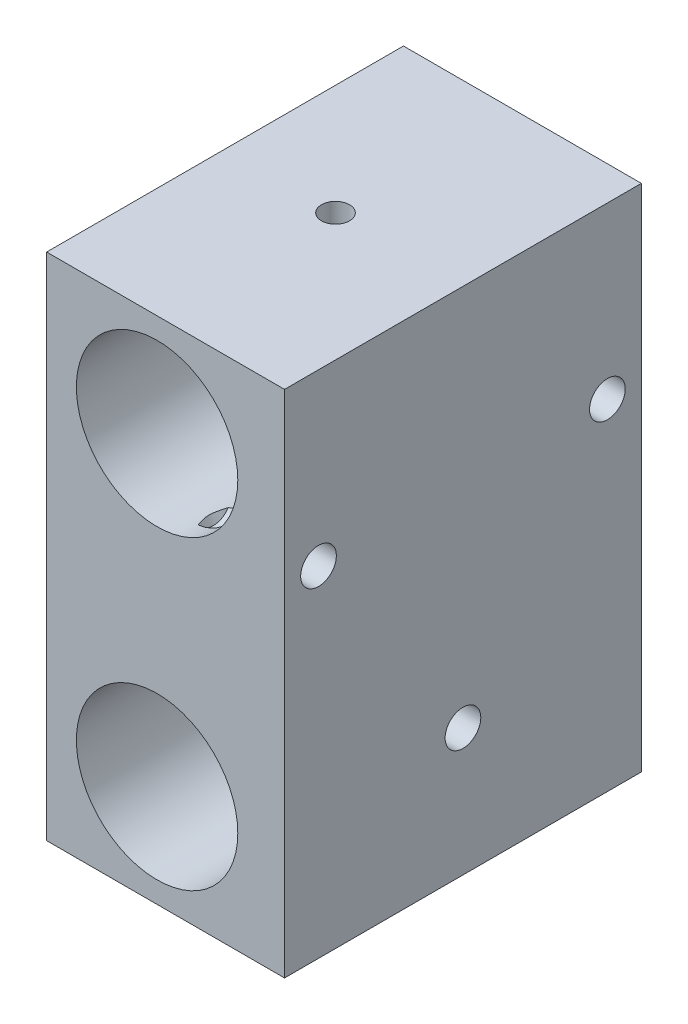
ISO-10303-21;
HEADER;
FILE_DESCRIPTION(('STEP AP214'),'2;1');
FILE_NAME('part.step','',(''),(''),'','','');
FILE_SCHEMA(('AUTOMOTIVE_DESIGN { 1 0 10303 214 1 1 1 1 }'));
ENDSEC;
DATA;
#1=APPLICATION_CONTEXT('core data for automotive mechanical design processes');
#2=APPLICATION_PROTOCOL_DEFINITION('international standard','automotive_design',2000,#1);
#3=PRODUCT_CONTEXT('',#1,'mechanical');
#4=PRODUCT('Part','Part','',(#3));
#5=PRODUCT_RELATED_PRODUCT_CATEGORY('part','',(#4));
#6=PRODUCT_DEFINITION_FORMATION('','',#4);
#7=PRODUCT_DEFINITION_CONTEXT('part definition',#1,'design');
#8=PRODUCT_DEFINITION('design','',#6,#7);
#9=PRODUCT_DEFINITION_SHAPE('','',#8);
#10=(LENGTH_UNIT() NAMED_UNIT(*) SI_UNIT(.MILLI.,.METRE.));
#11=(NAMED_UNIT(*) PLANE_ANGLE_UNIT() SI_UNIT($,.RADIAN.));
#12=(NAMED_UNIT(*) SI_UNIT($,.STERADIAN.) SOLID_ANGLE_UNIT());
#13=UNCERTAINTY_MEASURE_WITH_UNIT(LENGTH_MEASURE(1.E-05),#10,'distance_accuracy_value','');
#14=(GEOMETRIC_REPRESENTATION_CONTEXT(3) GLOBAL_UNCERTAINTY_ASSIGNED_CONTEXT((#13)) GLOBAL_UNIT_ASSIGNED_CONTEXT((#10,
#11,#12)) REPRESENTATION_CONTEXT('',''));
#15=CARTESIAN_POINT('',(0.,0.,0.));
#16=DIRECTION('',(0.,0.,1.));
#17=DIRECTION('',(1.,0.,0.));
#18=AXIS2_PLACEMENT_3D('',#15,#16,#17);
#19=CARTESIAN_POINT('',(14.,0.,-5.99999999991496));
#20=DIRECTION('',(0.,0.,-1.));
#21=DIRECTION('',(-1.,0.,0.));
#22=AXIS2_PLACEMENT_3D('',#19,#20,#21);
#23=CONICAL_SURFACE('',#22,2.49999999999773,1.02974425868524);
#24=CARTESIAN_POINT('',(14.,5.68422245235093E-11,-4.49784845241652));
#25=VERTEX_POINT('',#24);
#26=VERTEX_LOOP('',#25);
#27=FACE_BOUND('',#26,.T.);
#28=CARTESIAN_POINT('',(14.,0.,-6.));
#29=DIRECTION('',(0.,0.,-1.));
#30=DIRECTION('',(0.,1.,0.));
#31=AXIS2_PLACEMENT_3D('',#28,#29,#30);
#32=CIRCLE('',#31,2.5);
#33=CARTESIAN_POINT('',(14.,2.5,-6.));
#34=VERTEX_POINT('',#33);
#35=EDGE_CURVE('E86',#34,#34,#32,.T.);
#36=ORIENTED_EDGE('',*,*,#35,.T.);
#37=EDGE_LOOP('',(#36));
#38=FACE_BOUND('',#37,.T.);
#39=ADVANCED_FACE('F17',(#27,#38),#23,.F.);
#40=CARTESIAN_POINT('',(15.6000000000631,10.,-17.));
#41=DIRECTION('',(1.,0.,0.));
#42=DIRECTION('',(0.,0.,-1.));
#43=AXIS2_PLACEMENT_3D('',#40,#41,#42);
#44=CONICAL_SURFACE('',#43,2.10000000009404,1.02974425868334);
#45=CARTESIAN_POINT('',(15.6000000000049,8.86271375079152,-18.7653838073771));
#46=CARTESIAN_POINT('',(15.578058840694,8.85647008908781,-18.7179170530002));
#47=CARTESIAN_POINT('',(15.5563928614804,8.85039092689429,-18.6703017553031));
#48=CARTESIAN_POINT('',(15.5137294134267,8.83857796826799,-18.5747211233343));
#49=CARTESIAN_POINT('',(15.4927320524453,8.83284422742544,-18.5267557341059));
#50=CARTESIAN_POINT('',(15.430778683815,8.81614767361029,-18.3819226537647));
#51=CARTESIAN_POINT('',(15.3910250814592,8.80573585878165,-18.2844675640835));
#52=CARTESIAN_POINT('',(15.3154493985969,8.78640988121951,-18.0856419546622));
#53=CARTESIAN_POINT('',(15.2797207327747,8.77752944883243,-17.9842321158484));
#54=CARTESIAN_POINT('',(15.2155461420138,8.76190242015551,-17.779032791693));
#55=CARTESIAN_POINT('',(15.1870902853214,8.75515291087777,-17.6752467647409));
#56=CARTESIAN_POINT('',(15.1476650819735,8.74592972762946,-17.496865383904));
#57=CARTESIAN_POINT('',(15.1340102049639,8.74278040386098,-17.4229084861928));
#58=CARTESIAN_POINT('',(15.1129628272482,8.7379534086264,-17.2740522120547));
#59=CARTESIAN_POINT('',(15.1055685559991,8.73627532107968,-17.1991531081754));
#60=CARTESIAN_POINT('',(15.0978524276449,8.73452469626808,-17.0497107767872));
#61=CARTESIAN_POINT('',(15.0974606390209,8.73443628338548,-16.9751714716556));
#62=CARTESIAN_POINT('',(15.1036106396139,8.73583084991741,-16.8263965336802));
#63=CARTESIAN_POINT('',(15.1101535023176,8.73731407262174,-16.7521609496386));
#64=CARTESIAN_POINT('',(15.1333371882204,8.74262107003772,-16.575323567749));
#65=CARTESIAN_POINT('',(15.1529520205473,8.74713940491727,-16.4731377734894));
#66=CARTESIAN_POINT('',(15.2013889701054,8.75854485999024,-16.2711028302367));
#67=CARTESIAN_POINT('',(15.230221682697,8.76543470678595,-16.1712565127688));
#68=CARTESIAN_POINT('',(15.2945426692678,8.78120495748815,-15.9729019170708));
#69=CARTESIAN_POINT('',(15.330090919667,8.79010345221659,-15.8744150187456));
#70=CARTESIAN_POINT('',(15.4055636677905,8.80952764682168,-15.6793786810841));
#71=CARTESIAN_POINT('',(15.4454860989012,8.82005257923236,-15.5828283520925));
#72=CARTESIAN_POINT('',(15.5052870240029,8.83627249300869,-15.4445486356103));
#73=CARTESIAN_POINT('',(15.5239532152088,8.84139498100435,-15.4022189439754));
#74=CARTESIAN_POINT('',(15.561677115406,8.85187499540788,-15.3180943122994));
#75=CARTESIAN_POINT('',(15.5807315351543,8.85723079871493,-15.276297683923));
#76=CARTESIAN_POINT('',(15.6000000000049,8.86271375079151,-15.2346161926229));
#77=B_SPLINE_CURVE_WITH_KNOTS('',3,(#45,#46,#47,#48,#49,#50,#51,#52,#53,#54,#55,#56,#57,#58,#59,
#60,#61,#62,#63,#64,#65,#66,#67,#68,#69,#70,#71,#72,#73,#74,#75,#76),.UNSPECIFIED.,.F.,.F.,(4,2,
2,2,2,2,2,2,2,2,2,2,2,2,2,4),(0.,0.157989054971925,0.316003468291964,0.633197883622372,
0.956671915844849,1.27970182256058,1.50528927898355,1.73081291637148,1.95408304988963,
2.17738775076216,2.48917756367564,2.80132705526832,3.11640880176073,3.43134232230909,
3.57097549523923,3.70971081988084),.UNSPECIFIED.);
#78=CARTESIAN_POINT('',(15.6000000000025,8.86271375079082,-18.7653838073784));
#79=VERTEX_POINT('',#78);
#80=CARTESIAN_POINT('',(15.6000000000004,8.86271375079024,-15.2346161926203));
#81=VERTEX_POINT('',#80);
#82=EDGE_CURVE('E81',#79,#81,#77,.T.);
#83=ORIENTED_EDGE('',*,*,#82,.T.);
#84=CARTESIAN_POINT('',(15.6,10.,-17.));
#85=DIRECTION('',(1.,0.,0.));
#86=DIRECTION('',(0.,0.,-1.));
#87=AXIS2_PLACEMENT_3D('',#84,#85,#86);
#88=CIRCLE('',#87,2.09999999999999);
#89=EDGE_CURVE('E74',#81,#79,#88,.T.);
#90=ORIENTED_EDGE('',*,*,#89,.T.);
#91=EDGE_LOOP('',(#83,#90));
#92=FACE_BOUND('',#91,.T.);
#93=ADVANCED_FACE('F89',(#92),#44,.F.);
#94=CARTESIAN_POINT('',(15.6000000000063,10.,17.));
#95=DIRECTION('',(1.,0.,0.));
#96=DIRECTION('',(0.,0.,-1.));
#97=AXIS2_PLACEMENT_3D('',#94,#95,#96);
#98=CONICAL_SURFACE('',#97,2.09999999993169,1.0297442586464);
#99=CARTESIAN_POINT('',(15.6000000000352,8.86271375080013,15.234616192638));
#100=CARTESIAN_POINT('',(15.5780588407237,8.85647008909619,15.2820829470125));
#101=CARTESIAN_POINT('',(15.5563928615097,8.85039092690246,15.3296982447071));
#102=CARTESIAN_POINT('',(15.5137294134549,8.83857796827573,15.4252788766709));
#103=CARTESIAN_POINT('',(15.4927320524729,8.83284422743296,15.4732442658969));
#104=CARTESIAN_POINT('',(15.430778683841,8.81614767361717,15.6180773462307));
#105=CARTESIAN_POINT('',(15.391025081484,8.8057358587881,15.7155324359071));
#106=CARTESIAN_POINT('',(15.3154493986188,8.78640988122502,15.9143580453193));
#107=CARTESIAN_POINT('',(15.279720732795,8.77752944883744,16.0157678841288));
#108=CARTESIAN_POINT('',(15.2155461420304,8.76190242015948,16.220967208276));
#109=CARTESIAN_POINT('',(15.187090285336,8.75515291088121,16.324753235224));
#110=CARTESIAN_POINT('',(15.1476650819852,8.74592972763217,16.5031346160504));
#111=CARTESIAN_POINT('',(15.1340102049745,8.74278040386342,16.5770915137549));
#112=CARTESIAN_POINT('',(15.1129628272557,8.73795340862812,16.72594778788));
#113=CARTESIAN_POINT('',(15.1055685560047,8.73627532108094,16.8008468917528));
#114=CARTESIAN_POINT('',(15.0978524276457,8.73452469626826,16.9502892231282));
#115=CARTESIAN_POINT('',(15.097460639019,8.73443628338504,17.0248285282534));
#116=CARTESIAN_POINT('',(15.1036106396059,8.73583084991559,17.1736034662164));
#117=CARTESIAN_POINT('',(15.1101535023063,8.73731407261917,17.2478390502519));
#118=CARTESIAN_POINT('',(15.1333371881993,8.74262107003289,17.4246764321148));
#119=CARTESIAN_POINT('',(15.1529520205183,8.74713940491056,17.526862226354));
#120=CARTESIAN_POINT('',(15.2013889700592,8.75854485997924,17.7288971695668));
#121=CARTESIAN_POINT('',(15.2302216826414,8.76543470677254,17.8287434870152));
#122=CARTESIAN_POINT('',(15.2945426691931,8.78120495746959,18.0270980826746));
#123=CARTESIAN_POINT('',(15.3300909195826,8.79010345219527,18.1255849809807));
#124=CARTESIAN_POINT('',(15.4055636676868,8.80952764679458,18.3206213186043));
#125=CARTESIAN_POINT('',(15.4454860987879,8.82005257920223,18.4171716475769));
#126=CARTESIAN_POINT('',(15.5052870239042,8.83627249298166,18.5554513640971));
#127=CARTESIAN_POINT('',(15.5239532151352,8.84139498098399,18.5977810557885));
#128=CARTESIAN_POINT('',(15.5616771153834,8.85187499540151,18.6819056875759));
#129=CARTESIAN_POINT('',(15.5807315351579,8.85723079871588,18.7237023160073));
#130=CARTESIAN_POINT('',(15.6000000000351,8.86271375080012,18.765383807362));
#131=B_SPLINE_CURVE_WITH_KNOTS('',3,(#99,#100,#101,#102,#103,#104,#105,#106,#107,#108,#109,#110,
#111,#112,#113,#114,#115,#116,#117,#118,#119,#120,#121,#122,#123,#124,#125,#126,#127,#128,#129,
#130),.UNSPECIFIED.,.F.,.F.,(4,2,2,2,2,2,2,2,2,2,2,2,2,2,2,4),(0.,0.157989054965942,
0.316003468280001,0.633197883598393,0.956671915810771,1.27970182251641,1.50528927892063,
1.73081291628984,1.95408304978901,2.17738775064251,2.48917756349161,2.80132705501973,
3.11640880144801,3.43134232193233,3.57097549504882,3.70971081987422),.UNSPECIFIED.);
#132=CARTESIAN_POINT('',(15.6000000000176,8.86271375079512,15.2346161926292));
#133=VERTEX_POINT('',#132);
#134=CARTESIAN_POINT('',(15.6000000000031,8.86271375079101,18.7653838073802));
#135=VERTEX_POINT('',#134);
#136=EDGE_CURVE('E90',#133,#135,#131,.T.);
#137=ORIENTED_EDGE('',*,*,#136,.T.);
#138=CARTESIAN_POINT('',(15.6,10.,17.));
#139=DIRECTION('',(1.,0.,0.));
#140=DIRECTION('',(0.,0.,-1.));
#141=AXIS2_PLACEMENT_3D('',#138,#139,#140);
#142=CIRCLE('',#141,2.09999999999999);
#143=EDGE_CURVE('E87',#135,#133,#142,.T.);
#144=ORIENTED_EDGE('',*,*,#143,.T.);
#145=EDGE_LOOP('',(#137,#144));
#146=FACE_BOUND('',#145,.T.);
#147=ADVANCED_FACE('F142',(#146),#98,.F.);
#148=CARTESIAN_POINT('',(28.,-15.,0.));
#149=DIRECTION('',(1.,0.,0.));
#150=DIRECTION('',(0.,0.,-1.));
#151=AXIS2_PLACEMENT_3D('',#148,#149,#150);
#152=CYLINDRICAL_SURFACE('',#151,2.09999999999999);
#153=CARTESIAN_POINT('',(28.,-15.,0.));
#154=DIRECTION('',(1.,0.,0.));
#155=DIRECTION('',(0.,0.,-1.));
#156=AXIS2_PLACEMENT_3D('',#153,#154,#155);
#157=CIRCLE('',#156,2.09999999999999);
#158=CARTESIAN_POINT('',(28.,-15.,-2.09999999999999));
#159=VERTEX_POINT('',#158);
#160=EDGE_CURVE('E190',#159,#159,#157,.F.);
#161=ORIENTED_EDGE('',*,*,#160,.F.);
#162=EDGE_LOOP('',(#161));
#163=FACE_BOUND('',#162,.T.);
#164=CARTESIAN_POINT('',(22.01387818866,-15.,2.09999999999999));
#165=CARTESIAN_POINT('',(21.9717955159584,-14.8735703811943,2.09999446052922));
#166=CARTESIAN_POINT('',(21.9269801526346,-14.7478845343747,2.08854158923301));
#167=CARTESIAN_POINT('',(21.8334432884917,-14.5017555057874,2.04388629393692));
#168=CARTESIAN_POINT('',(21.7847127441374,-14.3813255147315,2.01063216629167));
#169=CARTESIAN_POINT('',(21.6854676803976,-14.1492169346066,1.92391922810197));
#170=CARTESIAN_POINT('',(21.6349586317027,-14.0375144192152,1.87051817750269));
#171=CARTESIAN_POINT('',(21.5342785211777,-13.8250845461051,1.74493709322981));
#172=CARTESIAN_POINT('',(21.4841074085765,-13.7243555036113,1.67275994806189));
#173=CARTESIAN_POINT('',(21.3851784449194,-13.5333790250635,1.50843392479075));
#174=CARTESIAN_POINT('',(21.3365130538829,-13.4435549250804,1.41573379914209));
#175=CARTESIAN_POINT('',(21.2456900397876,-13.2811800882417,1.21345605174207));
#176=CARTESIAN_POINT('',(21.2035308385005,-13.2086251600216,1.10388253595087));
#177=CARTESIAN_POINT('',(21.132190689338,-13.088580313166,0.878390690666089));
#178=CARTESIAN_POINT('',(21.1023058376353,-13.0396871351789,0.763459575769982));
#179=CARTESIAN_POINT('',(21.0665964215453,-12.9819799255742,0.584415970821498));
#180=CARTESIAN_POINT('',(21.0562137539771,-12.9653508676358,0.523636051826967));
#181=CARTESIAN_POINT('',(21.0387748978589,-12.937553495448,0.400380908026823));
#182=CARTESIAN_POINT('',(21.0317180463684,-12.9263840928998,0.337906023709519));
#183=CARTESIAN_POINT('',(21.0175274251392,-12.9039649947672,0.167996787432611));
#184=CARTESIAN_POINT('',(21.0137513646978,-12.8980586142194,0.0595034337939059));
#185=CARTESIAN_POINT('',(21.0169385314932,-12.9030698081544,-0.156855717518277));
#186=CARTESIAN_POINT('',(21.0238985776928,-12.9139823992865,-0.264721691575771));
#187=CARTESIAN_POINT('',(21.0469248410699,-12.9505037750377,-0.468482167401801));
#188=CARTESIAN_POINT('',(21.0622742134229,-12.974957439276,-0.564669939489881));
#189=CARTESIAN_POINT('',(21.1003321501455,-13.0365413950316,-0.751330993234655));
#190=CARTESIAN_POINT('',(21.1230423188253,-13.0736744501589,-0.841803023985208));
#191=CARTESIAN_POINT('',(21.1762010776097,-13.1623777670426,-1.02172783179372));
#192=CARTESIAN_POINT('',(21.2070931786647,-13.2148033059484,-1.1106252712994));
#193=CARTESIAN_POINT('',(21.2737448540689,-13.3309924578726,-1.2786158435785));
#194=CARTESIAN_POINT('',(21.3095064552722,-13.394760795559,-1.35770486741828));
#195=CARTESIAN_POINT('',(21.3894531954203,-13.5418587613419,-1.5156039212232));
#196=CARTESIAN_POINT('',(21.434113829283,-13.6266798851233,-1.5927855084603));
#197=CARTESIAN_POINT('',(21.5252668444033,-13.8071420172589,-1.73207990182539));
#198=CARTESIAN_POINT('',(21.5717611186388,-13.9027944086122,-1.79417663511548));
#199=CARTESIAN_POINT('',(21.6694416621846,-14.1134059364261,-1.90780665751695));
#200=CARTESIAN_POINT('',(21.7206106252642,-14.2293380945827,-1.95755846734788));
#201=CARTESIAN_POINT('',(21.8203767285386,-14.469034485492,-2.03565656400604));
#202=CARTESIAN_POINT('',(21.8689794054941,-14.5927804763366,-2.06405084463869));
#203=CARTESIAN_POINT('',(21.932407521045,-14.7651021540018,-2.08734757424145));
#204=CARTESIAN_POINT('',(21.9491746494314,-14.8117805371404,-2.09207615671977));
#205=CARTESIAN_POINT('',(21.9820430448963,-14.9055900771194,-2.09840360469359));
#206=CARTESIAN_POINT('',(21.998144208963,-14.9527213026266,-2.10000198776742));
#207=CARTESIAN_POINT('',(22.0522455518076,-15.1152892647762,-2.09999515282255));
#208=CARTESIAN_POINT('',(22.0884295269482,-15.2314554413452,-2.09047402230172));
#209=CARTESIAN_POINT('',(22.1555477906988,-15.4622000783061,-2.05184924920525));
#210=CARTESIAN_POINT('',(22.1864741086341,-15.576775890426,-2.02271620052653));
#211=CARTESIAN_POINT('',(22.2426645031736,-15.8007950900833,-1.94494031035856));
#212=CARTESIAN_POINT('',(22.2679211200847,-15.9102315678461,-1.896271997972));
#213=CARTESIAN_POINT('',(22.3127489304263,-16.1200454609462,-1.78040791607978));
#214=CARTESIAN_POINT('',(22.3323225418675,-16.2204267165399,-1.71322005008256));
#215=CARTESIAN_POINT('',(22.3657188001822,-16.4056648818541,-1.56453186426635));
#216=CARTESIAN_POINT('',(22.379705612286,-16.4909161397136,-1.4835590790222));
#217=CARTESIAN_POINT('',(22.403484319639,-16.6469559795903,-1.30817130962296));
#218=CARTESIAN_POINT('',(22.4132761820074,-16.7177444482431,-1.21375622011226));
#219=CARTESIAN_POINT('',(22.4293607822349,-16.8419620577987,-1.01525500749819));
#220=CARTESIAN_POINT('',(22.4356891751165,-16.895565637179,-0.911280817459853));
#221=CARTESIAN_POINT('',(22.4457096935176,-16.9848172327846,-0.695775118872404));
#222=CARTESIAN_POINT('',(22.4494018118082,-17.0204651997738,-0.584243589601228));
#223=CARTESIAN_POINT('',(22.4546879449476,-17.0728647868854,-0.356314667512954));
#224=CARTESIAN_POINT('',(22.4562736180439,-17.0895412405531,-0.239899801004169));
#225=CARTESIAN_POINT('',(22.4575845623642,-17.1032596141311,-0.00590701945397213));
#226=CARTESIAN_POINT('',(22.4573097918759,-17.1003010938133,0.111670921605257));
#227=CARTESIAN_POINT('',(22.4548487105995,-17.0747987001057,0.344992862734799));
#228=CARTESIAN_POINT('',(22.4526571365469,-17.0522009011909,0.4607309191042));
#229=CARTESIAN_POINT('',(22.4459994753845,-16.9880087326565,0.686747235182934));
#230=CARTESIAN_POINT('',(22.441533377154,-16.9464142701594,0.797025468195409));
#231=CARTESIAN_POINT('',(22.4297270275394,-16.8455253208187,1.00885220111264));
#232=CARTESIAN_POINT('',(22.4223899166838,-16.7862501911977,1.11041009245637));
#233=CARTESIAN_POINT('',(22.4040922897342,-16.6518037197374,1.30201302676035));
#234=CARTESIAN_POINT('',(22.3931322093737,-16.5766342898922,1.39205945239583));
#235=CARTESIAN_POINT('',(22.3668935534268,-16.4131441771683,1.55772443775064));
#236=CARTESIAN_POINT('',(22.3516350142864,-16.3248853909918,1.63340727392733));
#237=CARTESIAN_POINT('',(22.3161727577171,-16.1377493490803,1.76886110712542));
#238=CARTESIAN_POINT('',(22.2959676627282,-16.0388691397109,1.82862766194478));
#239=CARTESIAN_POINT('',(22.2502597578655,-15.8334864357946,1.93093144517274));
#240=CARTESIAN_POINT('',(22.2247469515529,-15.7269698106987,1.97343570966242));
#241=CARTESIAN_POINT('',(22.1685147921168,-15.5098461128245,2.04032641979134));
#242=CARTESIAN_POINT('',(22.1378028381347,-15.399245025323,2.06473835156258));
#243=CARTESIAN_POINT('',(22.0904414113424,-15.2402162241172,2.0867808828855));
#244=CARTESIAN_POINT('',(22.0757031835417,-15.1921271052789,2.09174784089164));
#245=CARTESIAN_POINT('',(22.0454002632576,-15.0959896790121,2.09835821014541));
#246=CARTESIAN_POINT('',(22.0298356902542,-15.0479413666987,2.10000210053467));
#247=CARTESIAN_POINT('',(22.01387818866,-15.,2.09999999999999));
#248=B_SPLINE_CURVE_WITH_KNOTS('',3,(#164,#165,#166,#167,#168,#169,#170,#171,#172,#173,#174,
#175,#176,#177,#178,#179,#180,#181,#182,#183,#184,#185,#186,#187,#188,#189,#190,#191,#192,#193,
#194,#195,#196,#197,#198,#199,#200,#201,#202,#203,#204,#205,#206,#207,#208,#209,#210,#211,#212,
#213,#214,#215,#216,#217,#218,#219,#220,#221,#222,#223,#224,#225,#226,#227,#228,#229,#230,#231,
#232,#233,#234,#235,#236,#237,#238,#239,#240,#241,#242,#243,#244,#245,#246,#247),.UNSPECIFIED.,
.T.,.F.,(4,2,2,2,2,2,2,2,2,2,2,2,2,2,2,2,2,2,2,2,2,2,2,2,2,2,2,2,2,2,2,2,2,2,2,2,2,2,2,2,2,4),
(0.,0.399552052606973,0.800055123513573,1.19941859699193,1.59872066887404,2.01043941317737,
2.42205812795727,2.80474663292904,2.99603655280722,3.18728832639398,3.51150982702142,
3.83563528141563,4.13561961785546,4.43566938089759,4.75759759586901,5.0796602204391,
5.44737174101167,5.81547335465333,6.22203357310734,6.62767743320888,6.77706517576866,
6.92647593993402,7.29081459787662,7.65570076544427,8.02106424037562,8.38627203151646,
8.73977874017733,9.09328821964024,9.44308651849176,9.79288577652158,10.1440661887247,
10.4952544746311,10.8474101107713,11.1995674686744,11.551340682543,11.9030716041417,
12.2531893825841,12.6034047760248,12.9542858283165,13.3046716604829,13.4562012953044,
13.6077090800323),.UNSPECIFIED.);
#249=CARTESIAN_POINT('',(22.01387818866,-15.,2.09999999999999));
#250=VERTEX_POINT('',#249);
#251=EDGE_CURVE('E83',#250,#250,#248,.T.);
#252=ORIENTED_EDGE('',*,*,#251,.T.);
#253=EDGE_LOOP('',(#252));
#254=FACE_BOUND('',#253,.T.);
#255=ADVANCED_FACE('F137',(#163,#254),#152,.F.);
#256=CARTESIAN_POINT('',(28.,10.,17.));
#257=DIRECTION('',(1.,0.,0.));
#258=DIRECTION('',(0.,0.,-1.));
#259=AXIS2_PLACEMENT_3D('',#256,#257,#258);
#260=CYLINDRICAL_SURFACE('',#259,2.09999999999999);
#261=CARTESIAN_POINT('',(28.,10.,17.));
#262=DIRECTION('',(1.,0.,0.));
#263=DIRECTION('',(0.,0.,-1.));
#264=AXIS2_PLACEMENT_3D('',#261,#262,#263);
#265=CIRCLE('',#264,2.09999999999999);
#266=CARTESIAN_POINT('',(28.,10.,14.9));
#267=VERTEX_POINT('',#266);
#268=EDGE_CURVE('E188',#267,#267,#265,.F.);
#269=ORIENTED_EDGE('',*,*,#268,.F.);
#270=EDGE_LOOP('',(#269));
#271=FACE_BOUND('',#270,.T.);
#272=ORIENTED_EDGE('',*,*,#143,.F.);
#273=CARTESIAN_POINT('',(15.6000000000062,8.8627137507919,18.7653838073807));
#274=CARTESIAN_POINT('',(15.8164353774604,8.92431926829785,18.8050675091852));
#275=CARTESIAN_POINT('',(16.0307223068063,8.99358938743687,18.8451254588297));
#276=CARTESIAN_POINT('',(16.4553755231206,9.14778421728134,18.9212399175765));
#277=CARTESIAN_POINT('',(16.6657209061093,9.23277517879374,18.9572784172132));
#278=CARTESIAN_POINT('',(17.0887019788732,9.42164917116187,19.0213444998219));
#279=CARTESIAN_POINT('',(17.3011325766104,9.52611662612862,19.0490248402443));
#280=CARTESIAN_POINT('',(17.7184688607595,9.75124032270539,19.0883399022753));
#281=CARTESIAN_POINT('',(17.9233892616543,9.87186248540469,19.1000078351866));
#282=CARTESIAN_POINT('',(18.2381662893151,10.0734494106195,19.0999955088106));
#283=CARTESIAN_POINT('',(18.3512688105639,10.1493681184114,19.0961547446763));
#284=CARTESIAN_POINT('',(18.573613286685,10.3056342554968,19.0791264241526));
#285=CARTESIAN_POINT('',(18.682857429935,10.3859791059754,19.0659442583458));
#286=CARTESIAN_POINT('',(18.8954764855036,10.5494204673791,19.028567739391));
#287=CARTESIAN_POINT('',(18.9989022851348,10.6324775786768,19.0044946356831));
#288=CARTESIAN_POINT('',(19.1998742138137,10.8007845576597,18.9433857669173));
#289=CARTESIAN_POINT('',(19.2974269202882,10.8860318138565,18.9063648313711));
#290=CARTESIAN_POINT('',(19.4869867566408,11.0584080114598,18.8164240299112));
#291=CARTESIAN_POINT('',(19.5788583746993,11.1455426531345,18.7632234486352));
#292=CARTESIAN_POINT('',(19.7529942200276,11.3170385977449,18.6390836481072));
#293=CARTESIAN_POINT('',(19.8352578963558,11.4013997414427,18.5681434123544));
#294=CARTESIAN_POINT('',(19.9761870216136,11.5508322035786,18.4192663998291));
#295=CARTESIAN_POINT('',(20.036542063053,11.6169035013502,18.3439533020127));
#296=CARTESIAN_POINT('',(20.1466450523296,11.74042260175,18.1796079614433));
#297=CARTESIAN_POINT('',(20.1963965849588,11.7978733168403,18.0905803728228));
#298=CARTESIAN_POINT('',(20.2838944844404,11.9008596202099,17.8992375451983));
#299=CARTESIAN_POINT('',(20.3215329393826,11.9462874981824,17.7968137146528));
#300=CARTESIAN_POINT('',(20.3825619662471,12.0208577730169,17.5822288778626));
#301=CARTESIAN_POINT('',(20.4059661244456,12.0500156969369,17.470077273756));
#302=CARTESIAN_POINT('',(20.4351027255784,12.0864817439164,17.2577178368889));
#303=CARTESIAN_POINT('',(20.4429601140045,12.0964122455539,17.1582434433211));
#304=CARTESIAN_POINT('',(20.4473586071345,12.1019603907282,16.9586634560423));
#305=CARTESIAN_POINT('',(20.4439050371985,12.0975847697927,16.8585581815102));
#306=CARTESIAN_POINT('',(20.426446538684,12.0756385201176,16.6678884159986));
#307=CARTESIAN_POINT('',(20.4131901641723,12.0590042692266,16.5771438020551));
#308=CARTESIAN_POINT('',(20.3774065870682,12.0146279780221,16.4003493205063));
#309=CARTESIAN_POINT('',(20.3548795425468,11.986886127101,16.314299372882));
#310=CARTESIAN_POINT('',(20.3003125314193,11.9207465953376,16.1460853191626));
#311=CARTESIAN_POINT('',(20.2679840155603,11.8820284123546,16.064142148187));
#312=CARTESIAN_POINT('',(20.1950198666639,11.7963840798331,15.908721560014));
#313=CARTESIAN_POINT('',(20.1543815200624,11.7494552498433,15.8352469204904));
#314=CARTESIAN_POINT('',(20.060475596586,11.6434873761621,15.6892644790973));
#315=CARTESIAN_POINT('',(20.0062788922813,11.5836712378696,15.617923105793));
#316=CARTESIAN_POINT('',(19.890097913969,11.4590639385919,15.4869494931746));
#317=CARTESIAN_POINT('',(19.8281085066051,11.394269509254,15.4273250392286));
#318=CARTESIAN_POINT('',(19.6599544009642,11.2238432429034,15.2881800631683));
#319=CARTESIAN_POINT('',(19.5489173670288,11.1161937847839,15.2169921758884));
#320=CARTESIAN_POINT('',(19.3147367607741,10.9007306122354,15.0989860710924));
#321=CARTESIAN_POINT('',(19.1915656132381,10.7929170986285,15.0522249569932));
#322=CARTESIAN_POINT('',(18.9169148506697,10.5651799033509,14.9733743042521));
#323=CARTESIAN_POINT('',(18.763976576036,10.4459029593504,14.9445904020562));
#324=CARTESIAN_POINT('',(18.4495884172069,10.2160410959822,14.9079006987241));
#325=CARTESIAN_POINT('',(18.2881378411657,10.10545688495,14.8999965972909));
#326=CARTESIAN_POINT('',(17.9740532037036,9.90430364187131,14.9000030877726));
#327=CARTESIAN_POINT('',(17.8219861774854,9.81282941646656,14.9065176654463));
#328=CARTESIAN_POINT('',(17.5135122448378,9.63880301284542,14.9294346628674));
#329=CARTESIAN_POINT('',(17.3571026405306,9.55625654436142,14.9458433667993));
#330=CARTESIAN_POINT('',(16.8820569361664,9.32219445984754,15.0058662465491));
#331=CARTESIAN_POINT('',(16.5578868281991,9.18443666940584,15.0602666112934));
#332=CARTESIAN_POINT('',(16.1245200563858,9.02784413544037,15.1381031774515));
#333=CARTESIAN_POINT('',(16.0201946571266,8.99219240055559,15.1572201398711));
#334=CARTESIAN_POINT('',(15.8107676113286,8.92466961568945,15.1957898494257));
#335=CARTESIAN_POINT('',(15.7056695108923,8.89278684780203,15.2152413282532));
#336=CARTESIAN_POINT('',(15.6000000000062,8.86271375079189,15.2346161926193));
#337=B_SPLINE_CURVE_WITH_KNOTS('',3,(#273,#274,#275,#276,#277,#278,#279,#280,#281,#282,#283,
#284,#285,#286,#287,#288,#289,#290,#291,#292,#293,#294,#295,#296,#297,#298,#299,#300,#301,#302,
#303,#304,#305,#306,#307,#308,#309,#310,#311,#312,#313,#314,#315,#316,#317,#318,#319,#320,#321,
#322,#323,#324,#325,#326,#327,#328,#329,#330,#331,#332,#333,#334,#335,#336),.UNSPECIFIED.,.F.,
.F.,(4,2,2,2,2,2,2,2,2,2,2,2,2,2,2,2,2,2,2,2,2,2,2,2,2,2,2,2,2,2,2,4),(0.,0.685540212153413,
1.37403812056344,2.08810724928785,2.80069307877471,3.2091527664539,3.61737693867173,
4.02116409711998,4.42449029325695,4.83525736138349,5.2460479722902,5.59553958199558,
5.94491284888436,6.29731755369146,6.64938536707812,6.94861716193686,7.24770809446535,
7.52605143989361,7.8043900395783,8.09188451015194,8.3794730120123,8.70145402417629,
9.0236482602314,9.53149772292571,10.040529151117,10.6268485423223,11.2132156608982,
11.7453117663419,12.2777461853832,13.3436132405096,13.6792713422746,14.0138567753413),.UNSPECIFIED.);
#338=EDGE_CURVE('E93',#135,#133,#337,.T.);
#339=ORIENTED_EDGE('',*,*,#338,.T.);
#340=EDGE_LOOP('',(#272,#339));
#341=FACE_BOUND('',#340,.T.);
#342=ADVANCED_FACE('F133',(#271,#341),#260,.F.);
#343=CARTESIAN_POINT('',(28.,10.,-17.));
#344=DIRECTION('',(1.,0.,0.));
#345=DIRECTION('',(0.,0.,-1.));
#346=AXIS2_PLACEMENT_3D('',#343,#344,#345);
#347=CYLINDRICAL_SURFACE('',#346,2.09999999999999);
#348=CARTESIAN_POINT('',(28.,10.,-17.));
#349=DIRECTION('',(1.,0.,0.));
#350=DIRECTION('',(0.,0.,-1.));
#351=AXIS2_PLACEMENT_3D('',#348,#349,#350);
#352=CIRCLE('',#351,2.09999999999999);
#353=CARTESIAN_POINT('',(28.,10.,-19.1));
#354=VERTEX_POINT('',#353);
#355=EDGE_CURVE('E185',#354,#354,#352,.F.);
#356=ORIENTED_EDGE('',*,*,#355,.F.);
#357=EDGE_LOOP('',(#356));
#358=FACE_BOUND('',#357,.T.);
#359=ORIENTED_EDGE('',*,*,#89,.F.);
#360=CARTESIAN_POINT('',(15.6000000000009,8.86271375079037,-15.2346161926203));
#361=CARTESIAN_POINT('',(15.8164353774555,8.92431926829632,-15.1949324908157));
#362=CARTESIAN_POINT('',(16.0307223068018,8.99358938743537,-15.1548745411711));
#363=CARTESIAN_POINT('',(16.4553755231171,9.14778421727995,-15.0787600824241));
#364=CARTESIAN_POINT('',(16.6657209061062,9.23277517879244,-15.0427215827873));
#365=CARTESIAN_POINT('',(17.088701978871,9.42164917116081,-14.9786555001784));
#366=CARTESIAN_POINT('',(17.3011325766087,9.52611662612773,-14.9509751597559));
#367=CARTESIAN_POINT('',(17.7184688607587,9.75124032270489,-14.9116600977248));
#368=CARTESIAN_POINT('',(17.9233892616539,9.87186248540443,-14.8999921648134));
#369=CARTESIAN_POINT('',(18.2381662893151,10.0734494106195,-14.9000044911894));
#370=CARTESIAN_POINT('',(18.3512688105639,10.1493681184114,-14.9038452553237));
#371=CARTESIAN_POINT('',(18.573613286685,10.3056342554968,-14.9208735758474));
#372=CARTESIAN_POINT('',(18.682857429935,10.3859791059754,-14.9340557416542));
#373=CARTESIAN_POINT('',(18.8954764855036,10.5494204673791,-14.971432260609));
#374=CARTESIAN_POINT('',(18.9989022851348,10.6324775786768,-14.9955053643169));
#375=CARTESIAN_POINT('',(19.1998742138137,10.8007845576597,-15.0566142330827));
#376=CARTESIAN_POINT('',(19.2974269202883,10.8860318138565,-15.0936351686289));
#377=CARTESIAN_POINT('',(19.4869867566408,11.0584080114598,-15.1835759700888));
#378=CARTESIAN_POINT('',(19.5788583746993,11.1455426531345,-15.2367765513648));
#379=CARTESIAN_POINT('',(19.7529942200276,11.3170385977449,-15.3609163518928));
#380=CARTESIAN_POINT('',(19.8352578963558,11.4013997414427,-15.4318565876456));
#381=CARTESIAN_POINT('',(19.9761870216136,11.5508322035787,-15.5807336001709));
#382=CARTESIAN_POINT('',(20.036542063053,11.6169035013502,-15.6560466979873));
#383=CARTESIAN_POINT('',(20.1466450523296,11.74042260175,-15.8203920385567));
#384=CARTESIAN_POINT('',(20.1963965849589,11.7978733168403,-15.9094196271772));
#385=CARTESIAN_POINT('',(20.2838944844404,11.9008596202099,-16.1007624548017));
#386=CARTESIAN_POINT('',(20.3215329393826,11.9462874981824,-16.2031862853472));
#387=CARTESIAN_POINT('',(20.3825619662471,12.0208577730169,-16.4177711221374));
#388=CARTESIAN_POINT('',(20.4059661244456,12.0500156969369,-16.529922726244));
#389=CARTESIAN_POINT('',(20.4351027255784,12.0864817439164,-16.7422821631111));
#390=CARTESIAN_POINT('',(20.4429601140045,12.096412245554,-16.8417565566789));
#391=CARTESIAN_POINT('',(20.4473586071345,12.1019603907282,-17.0413365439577));
#392=CARTESIAN_POINT('',(20.4439050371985,12.0975847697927,-17.1414418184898));
#393=CARTESIAN_POINT('',(20.426446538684,12.0756385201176,-17.3321115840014));
#394=CARTESIAN_POINT('',(20.4131901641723,12.0590042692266,-17.4228561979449));
#395=CARTESIAN_POINT('',(20.3774065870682,12.0146279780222,-17.5996506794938));
#396=CARTESIAN_POINT('',(20.3548795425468,11.986886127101,-17.685700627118));
#397=CARTESIAN_POINT('',(20.3003125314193,11.9207465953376,-17.8539146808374));
#398=CARTESIAN_POINT('',(20.2679840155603,11.8820284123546,-17.935857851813));
#399=CARTESIAN_POINT('',(20.1950198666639,11.7963840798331,-18.091278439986));
#400=CARTESIAN_POINT('',(20.1543815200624,11.7494552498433,-18.1647530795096));
#401=CARTESIAN_POINT('',(20.060475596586,11.6434873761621,-18.3107355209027));
#402=CARTESIAN_POINT('',(20.0062788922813,11.5836712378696,-18.382076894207));
#403=CARTESIAN_POINT('',(19.890097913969,11.4590639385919,-18.5130505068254));
#404=CARTESIAN_POINT('',(19.8281085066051,11.394269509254,-18.5726749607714));
#405=CARTESIAN_POINT('',(19.6599544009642,11.2238432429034,-18.7118199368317));
#406=CARTESIAN_POINT('',(19.5489173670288,11.1161937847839,-18.7830078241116));
#407=CARTESIAN_POINT('',(19.3147367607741,10.9007306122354,-18.9010139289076));
#408=CARTESIAN_POINT('',(19.1915656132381,10.7929170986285,-18.9477750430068));
#409=CARTESIAN_POINT('',(18.9169148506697,10.5651799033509,-19.0266256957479));
#410=CARTESIAN_POINT('',(18.763976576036,10.4459029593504,-19.0554095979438));
#411=CARTESIAN_POINT('',(18.4495884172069,10.2160410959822,-19.0920993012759));
#412=CARTESIAN_POINT('',(18.2881378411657,10.10545688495,-19.1000034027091));
#413=CARTESIAN_POINT('',(17.9740532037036,9.90430364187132,-19.0999969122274));
#414=CARTESIAN_POINT('',(17.8219861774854,9.81282941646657,-19.0934823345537));
#415=CARTESIAN_POINT('',(17.5135122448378,9.63880301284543,-19.0705653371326));
#416=CARTESIAN_POINT('',(17.3571026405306,9.55625654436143,-19.0541566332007));
#417=CARTESIAN_POINT('',(16.8820569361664,9.32219445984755,-18.9941337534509));
#418=CARTESIAN_POINT('',(16.5578868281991,9.18443666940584,-18.9397333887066));
#419=CARTESIAN_POINT('',(16.1245200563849,9.02784413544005,-18.8618968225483));
#420=CARTESIAN_POINT('',(16.0201946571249,8.99219240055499,-18.8427798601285));
#421=CARTESIAN_POINT('',(15.810767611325,8.92466961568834,-18.8042101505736));
#422=CARTESIAN_POINT('',(15.7056695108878,8.8927868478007,-18.784758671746));
#423=CARTESIAN_POINT('',(15.6000000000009,8.86271375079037,-18.7653838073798));
#424=B_SPLINE_CURVE_WITH_KNOTS('',3,(#360,#361,#362,#363,#364,#365,#366,#367,#368,#369,#370,
#371,#372,#373,#374,#375,#376,#377,#378,#379,#380,#381,#382,#383,#384,#385,#386,#387,#388,#389,
#390,#391,#392,#393,#394,#395,#396,#397,#398,#399,#400,#401,#402,#403,#404,#405,#406,#407,#408,
#409,#410,#411,#412,#413,#414,#415,#416,#417,#418,#419,#420,#421,#422,#423),.UNSPECIFIED.,.F.,
.F.,(4,2,2,2,2,2,2,2,2,2,2,2,2,2,2,2,2,2,2,2,2,2,2,2,2,2,2,2,2,2,2,4),(0.,0.685540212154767,
1.37403812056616,2.08810724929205,2.80069307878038,3.20915276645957,3.61737693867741,
4.02116409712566,4.42449029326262,4.83525736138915,5.24604797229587,5.59553958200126,
5.94491284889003,6.29731755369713,6.64938536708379,6.94861716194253,7.24770809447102,
7.52605143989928,7.80439003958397,8.09188451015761,8.37947301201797,8.70145402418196,
9.02364826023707,9.53149772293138,10.0405291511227,10.626848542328,11.2132156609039,
11.7453117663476,12.2777461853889,13.3436132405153,13.6792713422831,14.0138567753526),.UNSPECIFIED.);
#425=EDGE_CURVE('E79',#81,#79,#424,.T.);
#426=ORIENTED_EDGE('',*,*,#425,.T.);
#427=EDGE_LOOP('',(#359,#426));
#428=FACE_BOUND('',#427,.T.);
#429=ADVANCED_FACE('F85',(#358,#428),#347,.F.);
#430=CARTESIAN_POINT('',(13.,30.,0.));
#431=DIRECTION('',(0.,1.,0.));
#432=DIRECTION('',(0.,0.,1.));
#433=AXIS2_PLACEMENT_3D('',#430,#431,#432);
#434=CYLINDRICAL_SURFACE('',#433,1.65);
#435=CARTESIAN_POINT('',(13.,27.5,-1.65));
#436=CARTESIAN_POINT('',(13.0918488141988,27.4999981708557,-1.64999573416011));
#437=CARTESIAN_POINT('',(13.1838141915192,27.4986529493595,-1.64229813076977));
#438=CARTESIAN_POINT('',(13.3652315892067,27.4934124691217,-1.61170691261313));
#439=CARTESIAN_POINT('',(13.454678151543,27.4895120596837,-1.5887826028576));
#440=CARTESIAN_POINT('',(13.6283032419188,27.4795983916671,-1.52845196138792));
#441=CARTESIAN_POINT('',(13.7124883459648,27.4735878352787,-1.49106414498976));
#442=CARTESIAN_POINT('',(13.8733561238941,27.4601148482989,-1.40291189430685));
#443=CARTESIAN_POINT('',(13.9500415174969,27.452652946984,-1.35215233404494));
#444=CARTESIAN_POINT('',(14.0945725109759,27.4370149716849,-1.23812838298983));
#445=CARTESIAN_POINT('',(14.1623285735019,27.4288328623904,-1.17475130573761));
#446=CARTESIAN_POINT('',(14.286305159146,27.4127220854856,-1.03753096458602));
#447=CARTESIAN_POINT('',(14.3425243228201,27.4047934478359,-0.963686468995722));
#448=CARTESIAN_POINT('',(14.4421852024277,27.3900301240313,-0.807017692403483));
#449=CARTESIAN_POINT('',(14.4855388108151,27.3832031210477,-0.724136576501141));
#450=CARTESIAN_POINT('',(14.5576737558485,27.3714991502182,-0.55213035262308));
#451=CARTESIAN_POINT('',(14.5864562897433,27.3666220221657,-0.463005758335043));
#452=CARTESIAN_POINT('',(14.628351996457,27.3594295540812,-0.28198320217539));
#453=CARTESIAN_POINT('',(14.6416185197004,27.3570891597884,-0.190121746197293));
#454=CARTESIAN_POINT('',(14.6525812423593,27.3551594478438,-0.00544902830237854));
#455=CARTESIAN_POINT('',(14.6502786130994,27.355569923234,0.0873621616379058));
#456=CARTESIAN_POINT('',(14.6302931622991,27.3590727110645,0.270198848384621));
#457=CARTESIAN_POINT('',(14.6127834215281,27.3621348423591,0.360243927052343));
#458=CARTESIAN_POINT('',(14.5631524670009,27.3705486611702,0.536099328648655));
#459=CARTESIAN_POINT('',(14.5310305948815,27.3759004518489,0.621909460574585));
#460=CARTESIAN_POINT('',(14.4529125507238,27.3883230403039,0.787375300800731));
#461=CARTESIAN_POINT('',(14.4068447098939,27.3954026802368,0.866996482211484));
#462=CARTESIAN_POINT('',(14.3021970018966,27.4104765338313,1.01743791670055));
#463=CARTESIAN_POINT('',(14.2436169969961,27.4184707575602,1.0882580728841));
#464=CARTESIAN_POINT('',(14.1146795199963,27.4346042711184,1.22008311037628));
#465=CARTESIAN_POINT('',(14.0441758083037,27.4427440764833,1.28094496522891));
#466=CARTESIAN_POINT('',(13.8938448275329,27.4581573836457,1.39002415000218));
#467=CARTESIAN_POINT('',(13.8140134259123,27.4654304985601,1.43823584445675));
#468=CARTESIAN_POINT('',(13.6471326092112,27.4783033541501,1.52065791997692));
#469=CARTESIAN_POINT('',(13.5600707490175,27.4839001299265,1.55484353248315));
#470=CARTESIAN_POINT('',(13.3814361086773,27.4927582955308,1.60799774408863));
#471=CARTESIAN_POINT('',(13.2898732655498,27.4960246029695,1.62699839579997));
#472=CARTESIAN_POINT('',(13.1647006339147,27.4986293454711,1.64209240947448));
#473=CARTESIAN_POINT('',(13.1318367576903,27.4991422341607,1.6450553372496));
#474=CARTESIAN_POINT('',(13.0659869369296,27.4998278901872,1.64900989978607));
#475=CARTESIAN_POINT('',(13.033000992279,27.5000006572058,1.65000153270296));
#476=CARTESIAN_POINT('',(12.9081511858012,27.4999981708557,1.64999573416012));
#477=CARTESIAN_POINT('',(12.8161858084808,27.4986529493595,1.64229813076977));
#478=CARTESIAN_POINT('',(12.6347684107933,27.4934124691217,1.61170691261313));
#479=CARTESIAN_POINT('',(12.545321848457,27.4895120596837,1.5887826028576));
#480=CARTESIAN_POINT('',(12.3716967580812,27.4795983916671,1.52845196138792));
#481=CARTESIAN_POINT('',(12.2875116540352,27.4735878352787,1.49106414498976));
#482=CARTESIAN_POINT('',(12.1266438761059,27.4601148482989,1.40291189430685));
#483=CARTESIAN_POINT('',(12.0499584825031,27.452652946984,1.35215233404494));
#484=CARTESIAN_POINT('',(11.9054274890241,27.4370149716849,1.23812838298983));
#485=CARTESIAN_POINT('',(11.8376714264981,27.4288328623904,1.17475130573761));
#486=CARTESIAN_POINT('',(11.713694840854,27.4127220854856,1.03753096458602));
#487=CARTESIAN_POINT('',(11.6574756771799,27.4047934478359,0.963686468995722));
#488=CARTESIAN_POINT('',(11.5578147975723,27.3900301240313,0.807017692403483));
#489=CARTESIAN_POINT('',(11.5144611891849,27.3832031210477,0.724136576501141));
#490=CARTESIAN_POINT('',(11.4423262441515,27.3714991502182,0.55213035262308));
#491=CARTESIAN_POINT('',(11.4135437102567,27.3666220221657,0.463005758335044));
#492=CARTESIAN_POINT('',(11.371648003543,27.3594295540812,0.28198320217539));
#493=CARTESIAN_POINT('',(11.3583814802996,27.3570891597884,0.190121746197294));
#494=CARTESIAN_POINT('',(11.3474187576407,27.3551594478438,0.00544902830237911));
#495=CARTESIAN_POINT('',(11.3497213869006,27.355569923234,-0.0873621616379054));
#496=CARTESIAN_POINT('',(11.3697068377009,27.3590727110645,-0.270198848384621));
#497=CARTESIAN_POINT('',(11.387216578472,27.3621348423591,-0.360243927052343));
#498=CARTESIAN_POINT('',(11.4368475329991,27.3705486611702,-0.536099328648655));
#499=CARTESIAN_POINT('',(11.4689694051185,27.3759004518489,-0.621909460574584));
#500=CARTESIAN_POINT('',(11.5470874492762,27.3883230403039,-0.787375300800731));
#501=CARTESIAN_POINT('',(11.5931552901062,27.3954026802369,-0.866996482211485));
#502=CARTESIAN_POINT('',(11.6978029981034,27.4104765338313,-1.01743791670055));
#503=CARTESIAN_POINT('',(11.7563830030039,27.4184707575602,-1.0882580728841));
#504=CARTESIAN_POINT('',(11.8853204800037,27.4346042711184,-1.22008311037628));
#505=CARTESIAN_POINT('',(11.9558241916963,27.4427440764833,-1.28094496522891));
#506=CARTESIAN_POINT('',(12.1061551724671,27.4581573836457,-1.39002415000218));
#507=CARTESIAN_POINT('',(12.1859865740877,27.4654304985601,-1.43823584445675));
#508=CARTESIAN_POINT('',(12.3528673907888,27.4783033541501,-1.52065791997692));
#509=CARTESIAN_POINT('',(12.4399292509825,27.4839001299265,-1.55484353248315));
#510=CARTESIAN_POINT('',(12.6185638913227,27.4927582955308,-1.60799774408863));
#511=CARTESIAN_POINT('',(12.7101267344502,27.4960246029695,-1.62699839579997));
#512=CARTESIAN_POINT('',(12.8352993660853,27.4986293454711,-1.64209240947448));
#513=CARTESIAN_POINT('',(12.8681632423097,27.4991422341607,-1.6450553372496));
#514=CARTESIAN_POINT('',(12.9340130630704,27.4998278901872,-1.64900989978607));
#515=CARTESIAN_POINT('',(12.966999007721,27.5000006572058,-1.65000153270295));
#516=CARTESIAN_POINT('',(13.,27.5,-1.65));
#517=B_SPLINE_CURVE_WITH_KNOTS('',3,(#435,#436,#437,#438,#439,#440,#441,#442,#443,#444,#445,
#446,#447,#448,#449,#450,#451,#452,#453,#454,#455,#456,#457,#458,#459,#460,#461,#462,#463,#464,
#465,#466,#467,#468,#469,#470,#471,#472,#473,#474,#475,#476,#477,#478,#479,#480,#481,#482,#483,
#484,#485,#486,#487,#488,#489,#490,#491,#492,#493,#494,#495,#496,#497,#498,#499,#500,#501,#502,
#503,#504,#505,#506,#507,#508,#509,#510,#511,#512,#513,#514,#515,#516),.UNSPECIFIED.,.T.,.F.,(4,
2,2,2,2,2,2,2,2,2,2,2,2,2,2,2,2,2,2,2,2,2,2,2,2,2,2,2,2,2,2,2,2,2,2,2,2,2,2,2,4),(0.,
0.275420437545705,0.551397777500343,0.827022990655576,1.10254787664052,1.38065378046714,
1.65879243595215,1.93879410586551,2.21877276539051,2.49596026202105,2.77312690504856,
3.04717969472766,3.32124483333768,3.59674302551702,3.8722442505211,4.15140860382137,
4.43069711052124,4.71047670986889,4.98966417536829,5.08862178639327,5.18757949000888,
5.46299992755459,5.73897726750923,6.01460248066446,6.29012736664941,6.56823327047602,
6.84637192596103,7.12637359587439,7.40635225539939,7.68353975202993,7.96070639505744,
8.23475918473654,8.50882432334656,8.7843225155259,9.05982374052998,9.33898809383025,
9.61827660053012,9.89805619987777,10.1772436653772,10.2762012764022,10.3751589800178),.UNSPECIFIED.);
#518=CARTESIAN_POINT('',(13.,27.5,-1.65));
#519=VERTEX_POINT('',#518);
#520=EDGE_CURVE('E121',#519,#519,#517,.T.);
#521=ORIENTED_EDGE('',*,*,#520,.T.);
#522=EDGE_LOOP('',(#521));
#523=FACE_BOUND('',#522,.T.);
#524=CARTESIAN_POINT('',(13.,30.,0.));
#525=DIRECTION('',(0.,1.,0.));
#526=DIRECTION('',(0.,0.,1.));
#527=AXIS2_PLACEMENT_3D('',#524,#525,#526);
#528=CIRCLE('',#527,1.65);
#529=CARTESIAN_POINT('',(13.,30.,1.65));
#530=VERTEX_POINT('',#529);
#531=EDGE_CURVE('E182',#530,#530,#528,.T.);
#532=ORIENTED_EDGE('',*,*,#531,.T.);
#533=EDGE_LOOP('',(#532));
#534=FACE_BOUND('',#533,.T.);
#535=ADVANCED_FACE('F197',(#523,#534),#434,.F.);
#536=CARTESIAN_POINT('',(13.,-30.,0.));
#537=DIRECTION('',(0.,-1.,0.));
#538=DIRECTION('',(0.,0.,-1.));
#539=AXIS2_PLACEMENT_3D('',#536,#537,#538);
#540=CYLINDRICAL_SURFACE('',#539,1.65);
#541=CARTESIAN_POINT('',(13.,-27.5,1.65));
#542=CARTESIAN_POINT('',(13.0918488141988,-27.4999981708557,1.64999573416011));
#543=CARTESIAN_POINT('',(13.1838141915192,-27.4986529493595,1.64229813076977));
#544=CARTESIAN_POINT('',(13.3652315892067,-27.4934124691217,1.61170691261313));
#545=CARTESIAN_POINT('',(13.454678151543,-27.4895120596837,1.5887826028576));
#546=CARTESIAN_POINT('',(13.6283032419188,-27.4795983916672,1.52845196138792));
#547=CARTESIAN_POINT('',(13.7124883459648,-27.4735878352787,1.49106414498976));
#548=CARTESIAN_POINT('',(13.8733561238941,-27.4601148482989,1.40291189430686));
#549=CARTESIAN_POINT('',(13.9500415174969,-27.452652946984,1.35215233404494));
#550=CARTESIAN_POINT('',(14.0945725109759,-27.4370149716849,1.23812838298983));
#551=CARTESIAN_POINT('',(14.1623285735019,-27.4288328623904,1.17475130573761));
#552=CARTESIAN_POINT('',(14.286305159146,-27.4127220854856,1.03753096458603));
#553=CARTESIAN_POINT('',(14.3425243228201,-27.4047934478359,0.963686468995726));
#554=CARTESIAN_POINT('',(14.4421852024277,-27.3900301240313,0.807017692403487));
#555=CARTESIAN_POINT('',(14.4855388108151,-27.3832031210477,0.724136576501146));
#556=CARTESIAN_POINT('',(14.5576737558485,-27.3714991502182,0.552130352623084));
#557=CARTESIAN_POINT('',(14.5864562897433,-27.3666220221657,0.463005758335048));
#558=CARTESIAN_POINT('',(14.628351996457,-27.3594295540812,0.281983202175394));
#559=CARTESIAN_POINT('',(14.6416185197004,-27.3570891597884,0.190121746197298));
#560=CARTESIAN_POINT('',(14.6525812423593,-27.3551594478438,0.00544902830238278));
#561=CARTESIAN_POINT('',(14.6502786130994,-27.355569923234,-0.0873621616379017));
#562=CARTESIAN_POINT('',(14.6302931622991,-27.3590727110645,-0.270198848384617));
#563=CARTESIAN_POINT('',(14.6127834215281,-27.3621348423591,-0.36024392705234));
#564=CARTESIAN_POINT('',(14.5631524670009,-27.3705486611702,-0.536099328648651));
#565=CARTESIAN_POINT('',(14.5310305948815,-27.3759004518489,-0.621909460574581));
#566=CARTESIAN_POINT('',(14.4529125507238,-27.3883230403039,-0.787375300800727));
#567=CARTESIAN_POINT('',(14.4068447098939,-27.3954026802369,-0.86699648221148));
#568=CARTESIAN_POINT('',(14.3021970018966,-27.4104765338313,-1.01743791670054));
#569=CARTESIAN_POINT('',(14.2436169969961,-27.4184707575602,-1.08825807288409));
#570=CARTESIAN_POINT('',(14.1146795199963,-27.4346042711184,-1.22008311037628));
#571=CARTESIAN_POINT('',(14.0441758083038,-27.4427440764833,-1.28094496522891));
#572=CARTESIAN_POINT('',(13.8938448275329,-27.4581573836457,-1.39002415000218));
#573=CARTESIAN_POINT('',(13.8140134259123,-27.4654304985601,-1.43823584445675));
#574=CARTESIAN_POINT('',(13.6471326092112,-27.4783033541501,-1.52065791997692));
#575=CARTESIAN_POINT('',(13.5600707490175,-27.4839001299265,-1.55484353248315));
#576=CARTESIAN_POINT('',(13.3814361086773,-27.4927582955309,-1.60799774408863));
#577=CARTESIAN_POINT('',(13.2898732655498,-27.4960246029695,-1.62699839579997));
#578=CARTESIAN_POINT('',(13.1647006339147,-27.4986293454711,-1.64209240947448));
#579=CARTESIAN_POINT('',(13.1318367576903,-27.4991422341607,-1.6450553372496));
#580=CARTESIAN_POINT('',(13.0659869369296,-27.4998278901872,-1.64900989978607));
#581=CARTESIAN_POINT('',(13.033000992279,-27.5000006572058,-1.65000153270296));
#582=CARTESIAN_POINT('',(12.9081511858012,-27.4999981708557,-1.64999573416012));
#583=CARTESIAN_POINT('',(12.8161858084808,-27.4986529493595,-1.64229813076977));
#584=CARTESIAN_POINT('',(12.6347684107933,-27.4934124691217,-1.61170691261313));
#585=CARTESIAN_POINT('',(12.545321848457,-27.4895120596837,-1.5887826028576));
#586=CARTESIAN_POINT('',(12.3716967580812,-27.4795983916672,-1.52845196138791));
#587=CARTESIAN_POINT('',(12.2875116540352,-27.4735878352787,-1.49106414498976));
#588=CARTESIAN_POINT('',(12.1266438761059,-27.4601148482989,-1.40291189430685));
#589=CARTESIAN_POINT('',(12.0499584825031,-27.452652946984,-1.35215233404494));
#590=CARTESIAN_POINT('',(11.9054274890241,-27.4370149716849,-1.23812838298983));
#591=CARTESIAN_POINT('',(11.8376714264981,-27.4288328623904,-1.17475130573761));
#592=CARTESIAN_POINT('',(11.713694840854,-27.4127220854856,-1.03753096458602));
#593=CARTESIAN_POINT('',(11.6574756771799,-27.4047934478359,-0.963686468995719));
#594=CARTESIAN_POINT('',(11.5578147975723,-27.3900301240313,-0.80701769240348));
#595=CARTESIAN_POINT('',(11.5144611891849,-27.3832031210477,-0.724136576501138));
#596=CARTESIAN_POINT('',(11.4423262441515,-27.3714991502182,-0.552130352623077));
#597=CARTESIAN_POINT('',(11.4135437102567,-27.3666220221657,-0.46300575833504));
#598=CARTESIAN_POINT('',(11.371648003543,-27.3594295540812,-0.281983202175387));
#599=CARTESIAN_POINT('',(11.3583814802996,-27.3570891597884,-0.19012174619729));
#600=CARTESIAN_POINT('',(11.3474187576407,-27.3551594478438,-0.00544902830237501));
#601=CARTESIAN_POINT('',(11.3497213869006,-27.355569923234,0.0873621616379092));
#602=CARTESIAN_POINT('',(11.3697068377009,-27.3590727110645,0.270198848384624));
#603=CARTESIAN_POINT('',(11.387216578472,-27.3621348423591,0.360243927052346));
#604=CARTESIAN_POINT('',(11.4368475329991,-27.3705486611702,0.536099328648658));
#605=CARTESIAN_POINT('',(11.4689694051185,-27.3759004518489,0.621909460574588));
#606=CARTESIAN_POINT('',(11.5470874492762,-27.3883230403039,0.787375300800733));
#607=CARTESIAN_POINT('',(11.5931552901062,-27.3954026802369,0.866996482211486));
#608=CARTESIAN_POINT('',(11.6978029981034,-27.4104765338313,1.01743791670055));
#609=CARTESIAN_POINT('',(11.7563830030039,-27.4184707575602,1.0882580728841));
#610=CARTESIAN_POINT('',(11.8853204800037,-27.4346042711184,1.22008311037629));
#611=CARTESIAN_POINT('',(11.9558241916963,-27.4427440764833,1.28094496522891));
#612=CARTESIAN_POINT('',(12.1061551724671,-27.4581573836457,1.39002415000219));
#613=CARTESIAN_POINT('',(12.1859865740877,-27.4654304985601,1.43823584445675));
#614=CARTESIAN_POINT('',(12.3528673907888,-27.4783033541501,1.52065791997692));
#615=CARTESIAN_POINT('',(12.4399292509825,-27.4839001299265,1.55484353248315));
#616=CARTESIAN_POINT('',(12.6185638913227,-27.4927582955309,1.60799774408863));
#617=CARTESIAN_POINT('',(12.7101267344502,-27.4960246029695,1.62699839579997));
#618=CARTESIAN_POINT('',(12.8352993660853,-27.4986293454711,1.64209240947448));
#619=CARTESIAN_POINT('',(12.8681632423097,-27.4991422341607,1.6450553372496));
#620=CARTESIAN_POINT('',(12.9340130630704,-27.4998278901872,1.64900989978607));
#621=CARTESIAN_POINT('',(12.966999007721,-27.5000006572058,1.65000153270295));
#622=CARTESIAN_POINT('',(13.,-27.5,1.65));
#623=B_SPLINE_CURVE_WITH_KNOTS('',3,(#541,#542,#543,#544,#545,#546,#547,#548,#549,#550,#551,
#552,#553,#554,#555,#556,#557,#558,#559,#560,#561,#562,#563,#564,#565,#566,#567,#568,#569,#570,
#571,#572,#573,#574,#575,#576,#577,#578,#579,#580,#581,#582,#583,#584,#585,#586,#587,#588,#589,
#590,#591,#592,#593,#594,#595,#596,#597,#598,#599,#600,#601,#602,#603,#604,#605,#606,#607,#608,
#609,#610,#611,#612,#613,#614,#615,#616,#617,#618,#619,#620,#621,#622),.UNSPECIFIED.,.T.,.F.,(4,
2,2,2,2,2,2,2,2,2,2,2,2,2,2,2,2,2,2,2,2,2,2,2,2,2,2,2,2,2,2,2,2,2,2,2,2,2,2,2,4),(0.,
0.275420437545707,0.551397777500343,0.827022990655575,1.10254787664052,1.38065378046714,
1.65879243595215,1.93879410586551,2.21877276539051,2.49596026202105,2.77312690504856,
3.04717969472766,3.32124483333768,3.59674302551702,3.8722442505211,4.15140860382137,
4.43069711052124,4.71047670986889,4.9896641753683,5.08862178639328,5.18757949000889,
5.46299992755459,5.73897726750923,6.01460248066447,6.29012736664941,6.56823327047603,
6.84637192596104,7.1263735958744,7.4063522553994,7.68353975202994,7.96070639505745,
8.23475918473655,8.50882432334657,8.78432251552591,9.05982374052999,9.33898809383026,
9.61827660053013,9.89805619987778,10.1772436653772,10.2762012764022,10.3751589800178),.UNSPECIFIED.);
#624=CARTESIAN_POINT('',(13.,-27.5,1.65));
#625=VERTEX_POINT('',#624);
#626=EDGE_CURVE('E20',#625,#625,#623,.T.);
#627=ORIENTED_EDGE('',*,*,#626,.T.);
#628=EDGE_LOOP('',(#627));
#629=FACE_BOUND('',#628,.T.);
#630=CARTESIAN_POINT('',(13.,-30.,0.));
#631=DIRECTION('',(0.,-1.,0.));
#632=DIRECTION('',(0.,0.,-1.));
#633=AXIS2_PLACEMENT_3D('',#630,#631,#632);
#634=CIRCLE('',#633,1.65);
#635=CARTESIAN_POINT('',(13.,-30.,-1.65));
#636=VERTEX_POINT('',#635);
#637=EDGE_CURVE('E169',#636,#636,#634,.T.);
#638=ORIENTED_EDGE('',*,*,#637,.T.);
#639=EDGE_LOOP('',(#638));
#640=FACE_BOUND('',#639,.T.);
#641=ADVANCED_FACE('F242',(#629,#640),#540,.F.);
#642=CARTESIAN_POINT('',(14.,0.,-21.));
#643=DIRECTION('',(0.,0.,-1.));
#644=DIRECTION('',(0.,1.,0.));
#645=AXIS2_PLACEMENT_3D('',#642,#643,#644);
#646=CYLINDRICAL_SURFACE('',#645,2.5);
#647=ORIENTED_EDGE('',*,*,#35,.F.);
#648=EDGE_LOOP('',(#647));
#649=FACE_BOUND('',#648,.T.);
#650=CARTESIAN_POINT('',(14.,0.,-21.));
#651=DIRECTION('',(0.,0.,-1.));
#652=DIRECTION('',(0.,1.,0.));
#653=AXIS2_PLACEMENT_3D('',#650,#651,#652);
#654=CIRCLE('',#653,2.5);
#655=CARTESIAN_POINT('',(14.,2.5,-21.));
#656=VERTEX_POINT('',#655);
#657=EDGE_CURVE('E165',#656,#656,#654,.T.);
#658=ORIENTED_EDGE('',*,*,#657,.T.);
#659=EDGE_LOOP('',(#658));
#660=FACE_BOUND('',#659,.T.);
#661=ADVANCED_FACE('F247',(#649,#660),#646,.F.);
#662=CARTESIAN_POINT('',(13.,-18.,-21.));
#663=DIRECTION('',(0.,0.,1.));
#664=DIRECTION('',(1.,0.,0.));
#665=AXIS2_PLACEMENT_3D('',#662,#663,#664);
#666=CYLINDRICAL_SURFACE('',#665,9.5);
#667=CARTESIAN_POINT('',(13.,-18.,-21.));
#668=DIRECTION('',(0.,0.,1.));
#669=DIRECTION('',(1.,0.,0.));
#670=AXIS2_PLACEMENT_3D('',#667,#668,#669);
#671=CIRCLE('',#670,9.5);
#672=CARTESIAN_POINT('',(22.5,-18.,-21.));
#673=VERTEX_POINT('',#672);
#674=EDGE_CURVE('E162',#673,#673,#671,.F.);
#675=ORIENTED_EDGE('',*,*,#674,.T.);
#676=EDGE_LOOP('',(#675));
#677=FACE_BOUND('',#676,.T.);
#678=ORIENTED_EDGE('',*,*,#251,.F.);
#679=EDGE_LOOP('',(#678));
#680=FACE_BOUND('',#679,.T.);
#681=CARTESIAN_POINT('',(13.,-18.,21.));
#682=DIRECTION('',(0.,0.,1.));
#683=DIRECTION('',(1.,0.,0.));
#684=AXIS2_PLACEMENT_3D('',#681,#682,#683);
#685=CIRCLE('',#684,9.5);
#686=CARTESIAN_POINT('',(22.5,-18.,21.));
#687=VERTEX_POINT('',#686);
#688=EDGE_CURVE('E178',#687,#687,#685,.T.);
#689=ORIENTED_EDGE('',*,*,#688,.T.);
#690=EDGE_LOOP('',(#689));
#691=FACE_BOUND('',#690,.T.);
#692=ORIENTED_EDGE('',*,*,#626,.F.);
#693=EDGE_LOOP('',(#692));
#694=FACE_BOUND('',#693,.T.);
#695=ADVANCED_FACE('F113',(#677,#680,#691,#694),#666,.F.);
#696=CARTESIAN_POINT('',(13.,18.,-21.));
#697=DIRECTION('',(0.,0.,1.));
#698=DIRECTION('',(1.,0.,0.));
#699=AXIS2_PLACEMENT_3D('',#696,#697,#698);
#700=CYLINDRICAL_SURFACE('',#699,9.5);
#701=CARTESIAN_POINT('',(13.,18.,-21.));
#702=DIRECTION('',(0.,0.,1.));
#703=DIRECTION('',(1.,0.,0.));
#704=AXIS2_PLACEMENT_3D('',#701,#702,#703);
#705=CIRCLE('',#704,9.5);
#706=CARTESIAN_POINT('',(22.5,18.,-21.));
#707=VERTEX_POINT('',#706);
#708=EDGE_CURVE('E159',#707,#707,#705,.F.);
#709=ORIENTED_EDGE('',*,*,#708,.T.);
#710=EDGE_LOOP('',(#709));
#711=FACE_BOUND('',#710,.T.);
#712=ORIENTED_EDGE('',*,*,#520,.F.);
#713=EDGE_LOOP('',(#712));
#714=FACE_BOUND('',#713,.T.);
#715=CARTESIAN_POINT('',(13.,18.,21.));
#716=DIRECTION('',(0.,0.,1.));
#717=DIRECTION('',(1.,0.,0.));
#718=AXIS2_PLACEMENT_3D('',#715,#716,#717);
#719=CIRCLE('',#718,9.5);
#720=CARTESIAN_POINT('',(22.5,18.,21.));
#721=VERTEX_POINT('',#720);
#722=EDGE_CURVE('E174',#721,#721,#719,.T.);
#723=ORIENTED_EDGE('',*,*,#722,.T.);
#724=EDGE_LOOP('',(#723));
#725=FACE_BOUND('',#724,.T.);
#726=ORIENTED_EDGE('',*,*,#338,.F.);
#727=ORIENTED_EDGE('',*,*,#136,.F.);
#728=EDGE_LOOP('',(#726,#727));
#729=FACE_BOUND('',#728,.T.);
#730=ORIENTED_EDGE('',*,*,#425,.F.);
#731=ORIENTED_EDGE('',*,*,#82,.F.);
#732=EDGE_LOOP('',(#730,#731));
#733=FACE_BOUND('',#732,.T.);
#734=ADVANCED_FACE('F80',(#711,#714,#725,#729,#733),#700,.F.);
#735=CARTESIAN_POINT('',(28.,0.,0.));
#736=DIRECTION('',(1.,0.,0.));
#737=DIRECTION('',(0.,0.,-1.));
#738=AXIS2_PLACEMENT_3D('',#735,#736,#737);
#739=PLANE('',#738);
#740=DIRECTION('',(0.,1.,0.));
#741=VECTOR('',#740,1.);
#742=CARTESIAN_POINT('',(28.,30.,21.));
#743=LINE('',#742,#741);
#744=CARTESIAN_POINT('',(28.,30.,21.));
#745=VERTEX_POINT('',#744);
#746=CARTESIAN_POINT('',(28.,-30.,21.));
#747=VERTEX_POINT('',#746);
#748=EDGE_CURVE('E173',#745,#747,#743,.F.);
#749=ORIENTED_EDGE('',*,*,#748,.T.);
#750=DIRECTION('',(0.,0.,1.));
#751=VECTOR('',#750,1.);
#752=CARTESIAN_POINT('',(28.,-30.,21.));
#753=LINE('',#752,#751);
#754=CARTESIAN_POINT('',(28.,-30.,-21.));
#755=VERTEX_POINT('',#754);
#756=EDGE_CURVE('E168',#747,#755,#753,.F.);
#757=ORIENTED_EDGE('',*,*,#756,.T.);
#758=DIRECTION('',(0.,-1.,0.));
#759=VECTOR('',#758,1.);
#760=CARTESIAN_POINT('',(28.,30.,-21.));
#761=LINE('',#760,#759);
#762=CARTESIAN_POINT('',(28.,30.,-21.));
#763=VERTEX_POINT('',#762);
#764=EDGE_CURVE('E426',#755,#763,#761,.F.);
#765=ORIENTED_EDGE('',*,*,#764,.T.);
#766=DIRECTION('',(0.,0.,-1.));
#767=VECTOR('',#766,1.);
#768=CARTESIAN_POINT('',(28.,30.,21.));
#769=LINE('',#768,#767);
#770=EDGE_CURVE('E181',#763,#745,#769,.F.);
#771=ORIENTED_EDGE('',*,*,#770,.T.);
#772=EDGE_LOOP('',(#749,#757,#765,#771));
#773=FACE_BOUND('',#772,.T.);
#774=ORIENTED_EDGE('',*,*,#355,.T.);
#775=EDGE_LOOP('',(#774));
#776=FACE_BOUND('',#775,.T.);
#777=ORIENTED_EDGE('',*,*,#268,.T.);
#778=EDGE_LOOP('',(#777));
#779=FACE_BOUND('',#778,.T.);
#780=ORIENTED_EDGE('',*,*,#160,.T.);
#781=EDGE_LOOP('',(#780));
#782=FACE_BOUND('',#781,.T.);
#783=ADVANCED_FACE('F112',(#773,#776,#779,#782),#739,.T.);
#784=CARTESIAN_POINT('',(28.,30.,21.));
#785=DIRECTION('',(0.,-1.,0.));
#786=DIRECTION('',(0.,0.,-1.));
#787=AXIS2_PLACEMENT_3D('',#784,#785,#786);
#788=PLANE('',#787);
#789=DIRECTION('',(1.,0.,0.));
#790=VECTOR('',#789,1.);
#791=CARTESIAN_POINT('',(28.,30.,21.));
#792=LINE('',#791,#790);
#793=CARTESIAN_POINT('',(0.,30.,21.));
#794=VERTEX_POINT('',#793);
#795=EDGE_CURVE('E177',#794,#745,#792,.T.);
#796=ORIENTED_EDGE('',*,*,#795,.T.);
#797=ORIENTED_EDGE('',*,*,#770,.F.);
#798=DIRECTION('',(1.,0.,0.));
#799=VECTOR('',#798,1.);
#800=CARTESIAN_POINT('',(28.,30.,-21.));
#801=LINE('',#800,#799);
#802=CARTESIAN_POINT('',(0.,30.,-21.));
#803=VERTEX_POINT('',#802);
#804=EDGE_CURVE('E435',#763,#803,#801,.F.);
#805=ORIENTED_EDGE('',*,*,#804,.T.);
#806=DIRECTION('',(0.,0.,-1.));
#807=VECTOR('',#806,1.);
#808=CARTESIAN_POINT('',(0.,30.,0.));
#809=LINE('',#808,#807);
#810=EDGE_CURVE('E416',#803,#794,#809,.F.);
#811=ORIENTED_EDGE('',*,*,#810,.T.);
#812=EDGE_LOOP('',(#796,#797,#805,#811));
#813=FACE_BOUND('',#812,.T.);
#814=ORIENTED_EDGE('',*,*,#531,.F.);
#815=EDGE_LOOP('',(#814));
#816=FACE_BOUND('',#815,.T.);
#817=ADVANCED_FACE('F229',(#813,#816),#788,.F.);
#818=CARTESIAN_POINT('',(28.,30.,21.));
#819=DIRECTION('',(0.,0.,-1.));
#820=DIRECTION('',(0.,1.,0.));
#821=AXIS2_PLACEMENT_3D('',#818,#819,#820);
#822=PLANE('',#821);
#823=DIRECTION('',(1.,0.,0.));
#824=VECTOR('',#823,1.);
#825=CARTESIAN_POINT('',(28.,-30.,21.));
#826=LINE('',#825,#824);
#827=CARTESIAN_POINT('',(0.,-30.,21.));
#828=VERTEX_POINT('',#827);
#829=EDGE_CURVE('E172',#828,#747,#826,.T.);
#830=ORIENTED_EDGE('',*,*,#829,.T.);
#831=ORIENTED_EDGE('',*,*,#748,.F.);
#832=ORIENTED_EDGE('',*,*,#795,.F.);
#833=DIRECTION('',(0.,1.,0.));
#834=VECTOR('',#833,1.);
#835=CARTESIAN_POINT('',(0.,0.,21.));
#836=LINE('',#835,#834);
#837=EDGE_CURVE('E429',#794,#828,#836,.F.);
#838=ORIENTED_EDGE('',*,*,#837,.T.);
#839=EDGE_LOOP('',(#830,#831,#832,#838));
#840=FACE_BOUND('',#839,.T.);
#841=ORIENTED_EDGE('',*,*,#722,.F.);
#842=EDGE_LOOP('',(#841));
#843=FACE_BOUND('',#842,.T.);
#844=ORIENTED_EDGE('',*,*,#688,.F.);
#845=EDGE_LOOP('',(#844));
#846=FACE_BOUND('',#845,.T.);
#847=ADVANCED_FACE('F226',(#840,#843,#846),#822,.F.);
#848=CARTESIAN_POINT('',(28.,-30.,21.));
#849=DIRECTION('',(0.,1.,0.));
#850=DIRECTION('',(0.,0.,1.));
#851=AXIS2_PLACEMENT_3D('',#848,#849,#850);
#852=PLANE('',#851);
#853=DIRECTION('',(1.,0.,0.));
#854=VECTOR('',#853,1.);
#855=CARTESIAN_POINT('',(28.,-30.,-21.));
#856=LINE('',#855,#854);
#857=CARTESIAN_POINT('',(0.,-30.,-21.));
#858=VERTEX_POINT('',#857);
#859=EDGE_CURVE('E38',#858,#755,#856,.T.);
#860=ORIENTED_EDGE('',*,*,#859,.T.);
#861=ORIENTED_EDGE('',*,*,#756,.F.);
#862=ORIENTED_EDGE('',*,*,#829,.F.);
#863=DIRECTION('',(0.,0.,-1.));
#864=VECTOR('',#863,1.);
#865=CARTESIAN_POINT('',(0.,-30.,0.));
#866=LINE('',#865,#864);
#867=EDGE_CURVE('E30',#828,#858,#866,.T.);
#868=ORIENTED_EDGE('',*,*,#867,.T.);
#869=EDGE_LOOP('',(#860,#861,#862,#868));
#870=FACE_BOUND('',#869,.T.);
#871=ORIENTED_EDGE('',*,*,#637,.F.);
#872=EDGE_LOOP('',(#871));
#873=FACE_BOUND('',#872,.T.);
#874=ADVANCED_FACE('F220',(#870,#873),#852,.F.);
#875=CARTESIAN_POINT('',(28.,30.,-21.));
#876=DIRECTION('',(0.,0.,1.));
#877=DIRECTION('',(0.,-1.,0.));
#878=AXIS2_PLACEMENT_3D('',#875,#876,#877);
#879=PLANE('',#878);
#880=ORIENTED_EDGE('',*,*,#804,.F.);
#881=ORIENTED_EDGE('',*,*,#764,.F.);
#882=ORIENTED_EDGE('',*,*,#859,.F.);
#883=DIRECTION('',(0.,1.,0.));
#884=VECTOR('',#883,1.);
#885=CARTESIAN_POINT('',(0.,0.,-21.));
#886=LINE('',#885,#884);
#887=EDGE_CURVE('E11',#858,#803,#886,.T.);
#888=ORIENTED_EDGE('',*,*,#887,.T.);
#889=EDGE_LOOP('',(#880,#881,#882,#888));
#890=FACE_BOUND('',#889,.T.);
#891=ORIENTED_EDGE('',*,*,#708,.F.);
#892=EDGE_LOOP('',(#891));
#893=FACE_BOUND('',#892,.T.);
#894=ORIENTED_EDGE('',*,*,#674,.F.);
#895=EDGE_LOOP('',(#894));
#896=FACE_BOUND('',#895,.T.);
#897=ORIENTED_EDGE('',*,*,#657,.F.);
#898=EDGE_LOOP('',(#897));
#899=FACE_BOUND('',#898,.T.);
#900=ADVANCED_FACE('F214',(#890,#893,#896,#899),#879,.F.);
#901=CARTESIAN_POINT('',(0.,0.,0.));
#902=DIRECTION('',(1.,0.,0.));
#903=DIRECTION('',(0.,0.,-1.));
#904=AXIS2_PLACEMENT_3D('',#901,#902,#903);
#905=PLANE('',#904);
#906=ORIENTED_EDGE('',*,*,#867,.F.);
#907=ORIENTED_EDGE('',*,*,#837,.F.);
#908=ORIENTED_EDGE('',*,*,#810,.F.);
#909=ORIENTED_EDGE('',*,*,#887,.F.);
#910=EDGE_LOOP('',(#906,#907,#908,#909));
#911=FACE_BOUND('',#910,.T.);
#912=ADVANCED_FACE('F212',(#911),#905,.F.);
#913=CLOSED_SHELL('',(#39,#93,#147,#255,#342,#429,#535,#641,#661,#695,#734,#783,#817,#847,#874,
#900,#912));
#914=MANIFOLD_SOLID_BREP('B1',#913);
#915=ADVANCED_BREP_SHAPE_REPRESENTATION('',(#18,#914),#14);
#916=SHAPE_DEFINITION_REPRESENTATION(#9,#915);
ENDSEC;
END-ISO-10303-21;
